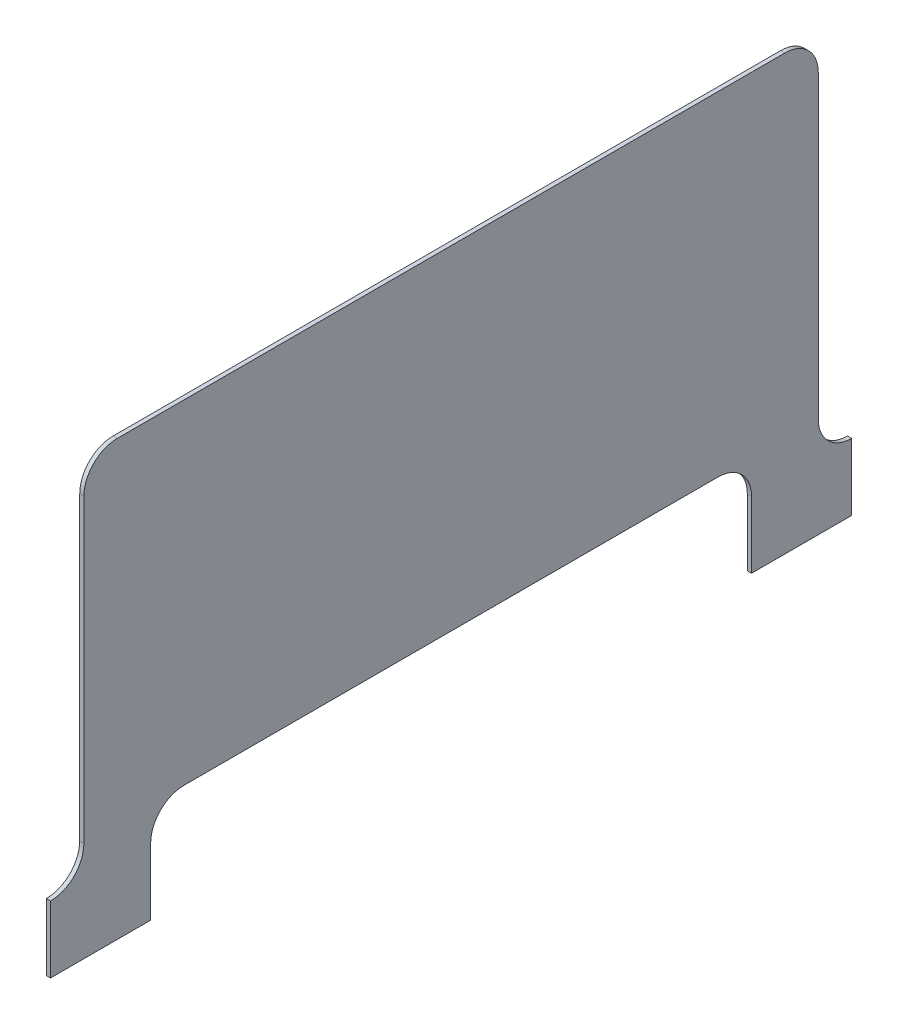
from build123d import *

# Parameters (mm, degrees)
SKETCH1_W          = 3.175
SKETCH1_H          = 330.2
EXTRUDE1_DEPTH     = 304.8
CUT_EXTRUDE1_DEPTH = 450.38308894
SKETCH3_W          = 457.2
SKETCH3_H          = 76.2
CUT_EXTRUDE2_DEPTH = 450.38308894
FILLET1_R          = 25.4


with BuildPart() as part:
    # Sketch1 → Extrude1 (new, symmetric)
    with BuildSketch(Plane.XY):
        with Locations((-77.7875, 165.1)):
            Rectangle(SKETCH1_W, SKETCH1_H)
    extrude(amount=EXTRUDE1_DEPTH, both=True)

    # Sketch2 → Cut-Extrude1 (cut, through all)
    with BuildSketch(Plane.ZY.offset(79.375)):
        with BuildLine():
            Line((279.4, 330.2), (279.4, 76.2))
            ThreePointArc((279.4, 76.2), (286.839487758, 58.239487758), (304.8, 50.8))
            Line((304.8, 50.8), (304.8, 330.2))
            Line((304.8, 330.2), (279.4, 330.2))
        make_face()
        with BuildLine():
            Line((-279.4, 330.2), (-279.4, 76.2))
            ThreePointArc((-279.4, 76.2), (-286.839487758, 58.239487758), (-304.8, 50.8))
            Line((-304.8, 50.8), (-304.8, 330.2))
            Line((-304.8, 330.2), (-279.4, 330.2))
        make_face()
    extrude(amount=-CUT_EXTRUDE1_DEPTH, mode=Mode.SUBTRACT)

    # Sketch3 → Cut-Extrude2 (cut, through all)
    with BuildSketch(Plane.ZY.offset(79.375)):
        with Locations((0, 38.1)):
            Rectangle(SKETCH3_W, SKETCH3_H)
    extrude(amount=-CUT_EXTRUDE2_DEPTH, mode=Mode.SUBTRACT)

    # Fillet1
    fillet1_edges = [part.edges().sort_by_distance(p)[0] for p in [
        (-77.7875, 330.2, 279.4),
        (-77.7875, 330.2, -279.4),
        (-77.7875, 76.2, -228.6),
        (-77.7875, 76.2, 228.6),
    ]]
    fillet(fillet1_edges, radius=FILLET1_R)


solid = part.part
